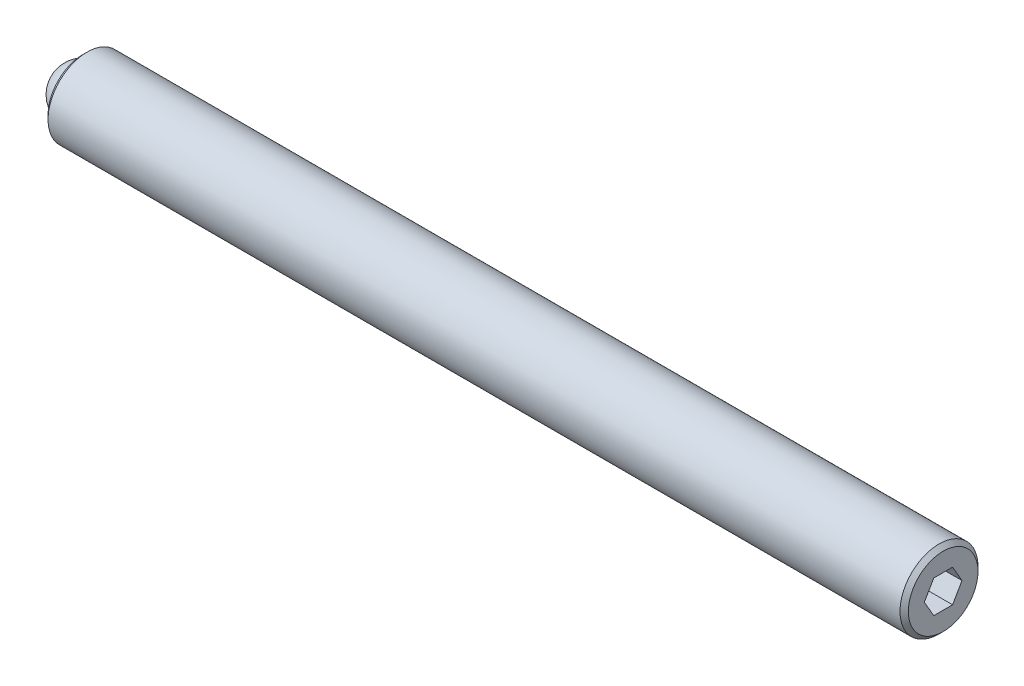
ISO-10303-21;
HEADER;
FILE_DESCRIPTION(('STEP AP214'),'2;1');
FILE_NAME('part.step','',(''),(''),'','','');
FILE_SCHEMA(('AUTOMOTIVE_DESIGN { 1 0 10303 214 1 1 1 1 }'));
ENDSEC;
DATA;
#1=APPLICATION_CONTEXT('core data for automotive mechanical design processes');
#2=APPLICATION_PROTOCOL_DEFINITION('international standard','automotive_design',2000,#1);
#3=PRODUCT_CONTEXT('',#1,'mechanical');
#4=PRODUCT('Part','Part','',(#3));
#5=PRODUCT_RELATED_PRODUCT_CATEGORY('part','',(#4));
#6=PRODUCT_DEFINITION_FORMATION('','',#4);
#7=PRODUCT_DEFINITION_CONTEXT('part definition',#1,'design');
#8=PRODUCT_DEFINITION('design','',#6,#7);
#9=PRODUCT_DEFINITION_SHAPE('','',#8);
#10=(LENGTH_UNIT() NAMED_UNIT(*) SI_UNIT(.MILLI.,.METRE.));
#11=(NAMED_UNIT(*) PLANE_ANGLE_UNIT() SI_UNIT($,.RADIAN.));
#12=(NAMED_UNIT(*) SI_UNIT($,.STERADIAN.) SOLID_ANGLE_UNIT());
#13=UNCERTAINTY_MEASURE_WITH_UNIT(LENGTH_MEASURE(1.E-05),#10,'distance_accuracy_value','');
#14=(GEOMETRIC_REPRESENTATION_CONTEXT(3) GLOBAL_UNCERTAINTY_ASSIGNED_CONTEXT((#13)) GLOBAL_UNIT_ASSIGNED_CONTEXT((#10,
#11,#12)) REPRESENTATION_CONTEXT('',''));
#15=CARTESIAN_POINT('',(0.,0.,0.));
#16=DIRECTION('',(0.,0.,1.));
#17=DIRECTION('',(1.,0.,0.));
#18=AXIS2_PLACEMENT_3D('',#15,#16,#17);
#19=CARTESIAN_POINT('',(0.,0.,0.));
#20=DIRECTION('',(0.,-1.,0.));
#21=DIRECTION('',(0.,0.,1.));
#22=AXIS2_PLACEMENT_3D('',#19,#20,#21);
#23=SPHERICAL_SURFACE('',#22,1.5875);
#24=CARTESIAN_POINT('',(0.,-1.5875,0.));
#25=VERTEX_POINT('',#24);
#26=VERTEX_LOOP('',#25);
#27=FACE_BOUND('',#26,.T.);
#28=ADVANCED_FACE('F41',(#27),#23,.T.);
#29=CLOSED_SHELL('',(#28));
#30=MANIFOLD_SOLID_BREP('B2',#29);
#31=CARTESIAN_POINT('',(52.3875,0.,0.));
#32=DIRECTION('',(-1.,0.,0.));
#33=DIRECTION('',(0.,0.,1.));
#34=AXIS2_PLACEMENT_3D('',#31,#32,#33);
#35=CYLINDRICAL_SURFACE('',#34,2.3749);
#36=CARTESIAN_POINT('',(52.1335,0.,0.));
#37=DIRECTION('',(1.,0.,0.));
#38=DIRECTION('',(0.,0.,-1.));
#39=AXIS2_PLACEMENT_3D('',#36,#37,#38);
#40=CIRCLE('',#39,2.3749);
#41=CARTESIAN_POINT('',(52.1335,0.,-2.3749));
#42=VERTEX_POINT('',#41);
#43=EDGE_CURVE('E39',#42,#42,#40,.F.);
#44=ORIENTED_EDGE('',*,*,#43,.T.);
#45=EDGE_LOOP('',(#44));
#46=FACE_BOUND('',#45,.T.);
#47=CARTESIAN_POINT('',(0.253999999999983,0.,0.));
#48=DIRECTION('',(1.,0.,0.));
#49=DIRECTION('',(0.,0.,-1.));
#50=AXIS2_PLACEMENT_3D('',#47,#48,#49);
#51=CIRCLE('',#50,2.3749);
#52=CARTESIAN_POINT('',(0.253999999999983,0.,-2.3749));
#53=VERTEX_POINT('',#52);
#54=EDGE_CURVE('E157',#53,#53,#51,.T.);
#55=ORIENTED_EDGE('',*,*,#54,.T.);
#56=EDGE_LOOP('',(#55));
#57=FACE_BOUND('',#56,.T.);
#58=ADVANCED_FACE('F54',(#46,#57),#35,.T.);
#59=CARTESIAN_POINT('',(52.3875,0.,0.));
#60=DIRECTION('',(1.,0.,0.));
#61=DIRECTION('',(0.,0.,-1.));
#62=AXIS2_PLACEMENT_3D('',#59,#60,#61);
#63=PLANE('',#62);
#64=DIRECTION('',(0.,0.866025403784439,-0.5));
#65=VECTOR('',#64,1.);
#66=CARTESIAN_POINT('',(52.3875,-0.992187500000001,-0.572839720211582));
#67=LINE('',#66,#65);
#68=CARTESIAN_POINT('',(52.3875,-0.992187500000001,-0.572839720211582));
#69=VERTEX_POINT('',#68);
#70=CARTESIAN_POINT('',(52.3875,0.,-1.14567944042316));
#71=VERTEX_POINT('',#70);
#72=EDGE_CURVE('E69',#69,#71,#67,.T.);
#73=ORIENTED_EDGE('',*,*,#72,.F.);
#74=DIRECTION('',(0.,0.,-1.));
#75=VECTOR('',#74,1.);
#76=CARTESIAN_POINT('',(52.3875,-0.992187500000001,0.572839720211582));
#77=LINE('',#76,#75);
#78=CARTESIAN_POINT('',(52.3875,-0.992187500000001,0.572839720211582));
#79=VERTEX_POINT('',#78);
#80=EDGE_CURVE('E153',#79,#69,#77,.T.);
#81=ORIENTED_EDGE('',*,*,#80,.F.);
#82=DIRECTION('',(0.,-0.866025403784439,-0.5));
#83=VECTOR('',#82,1.);
#84=CARTESIAN_POINT('',(52.3875,0.,1.14567944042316));
#85=LINE('',#84,#83);
#86=CARTESIAN_POINT('',(52.3875,0.,1.14567944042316));
#87=VERTEX_POINT('',#86);
#88=EDGE_CURVE('E151',#87,#79,#85,.T.);
#89=ORIENTED_EDGE('',*,*,#88,.F.);
#90=DIRECTION('',(0.,-0.866025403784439,0.5));
#91=VECTOR('',#90,1.);
#92=CARTESIAN_POINT('',(52.3875,0.992187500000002,0.572839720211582));
#93=LINE('',#92,#91);
#94=CARTESIAN_POINT('',(52.3875,0.992187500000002,0.572839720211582));
#95=VERTEX_POINT('',#94);
#96=EDGE_CURVE('E117',#95,#87,#93,.T.);
#97=ORIENTED_EDGE('',*,*,#96,.F.);
#98=DIRECTION('',(0.,0.,1.));
#99=VECTOR('',#98,1.);
#100=CARTESIAN_POINT('',(52.3875,0.992187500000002,-0.572839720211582));
#101=LINE('',#100,#99);
#102=CARTESIAN_POINT('',(52.3875,0.992187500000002,-0.572839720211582));
#103=VERTEX_POINT('',#102);
#104=EDGE_CURVE('E147',#103,#95,#101,.T.);
#105=ORIENTED_EDGE('',*,*,#104,.F.);
#106=DIRECTION('',(0.,0.866025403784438,0.5));
#107=VECTOR('',#106,1.);
#108=CARTESIAN_POINT('',(52.3875,0.,-1.14567944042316));
#109=LINE('',#108,#107);
#110=EDGE_CURVE('E143',#71,#103,#109,.T.);
#111=ORIENTED_EDGE('',*,*,#110,.F.);
#112=EDGE_LOOP('',(#73,#81,#89,#97,#105,#111));
#113=FACE_BOUND('',#112,.T.);
#114=CARTESIAN_POINT('',(52.3875,0.,0.));
#115=DIRECTION('',(1.,0.,0.));
#116=DIRECTION('',(0.,0.,-1.));
#117=AXIS2_PLACEMENT_3D('',#114,#115,#116);
#118=CIRCLE('',#117,2.12090000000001);
#119=CARTESIAN_POINT('',(52.3875,0.,-2.12090000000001));
#120=VERTEX_POINT('',#119);
#121=EDGE_CURVE('E62',#120,#120,#118,.T.);
#122=ORIENTED_EDGE('',*,*,#121,.T.);
#123=EDGE_LOOP('',(#122));
#124=FACE_BOUND('',#123,.T.);
#125=ADVANCED_FACE('F170',(#113,#124),#63,.T.);
#126=CARTESIAN_POINT('',(0.,0.,0.));
#127=DIRECTION('',(1.,0.,0.));
#128=DIRECTION('',(0.,0.,-1.));
#129=AXIS2_PLACEMENT_3D('',#126,#127,#128);
#130=PLANE('',#129);
#131=CARTESIAN_POINT('',(0.,0.,0.));
#132=DIRECTION('',(-1.,0.,0.));
#133=DIRECTION('',(0.,0.,1.));
#134=AXIS2_PLACEMENT_3D('',#131,#132,#133);
#135=CIRCLE('',#134,1.5875);
#136=CARTESIAN_POINT('',(0.,0.,1.5875));
#137=VERTEX_POINT('',#136);
#138=EDGE_CURVE('E225',#137,#137,#135,.T.);
#139=ORIENTED_EDGE('',*,*,#138,.F.);
#140=EDGE_LOOP('',(#139));
#141=FACE_BOUND('',#140,.T.);
#142=CARTESIAN_POINT('',(0.,0.,0.));
#143=DIRECTION('',(1.,0.,0.));
#144=DIRECTION('',(0.,0.,-1.));
#145=AXIS2_PLACEMENT_3D('',#142,#143,#144);
#146=CIRCLE('',#145,2.12090000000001);
#147=CARTESIAN_POINT('',(0.,0.,-2.12090000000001));
#148=VERTEX_POINT('',#147);
#149=EDGE_CURVE('E165',#148,#148,#146,.F.);
#150=ORIENTED_EDGE('',*,*,#149,.T.);
#151=EDGE_LOOP('',(#150));
#152=FACE_BOUND('',#151,.T.);
#153=ADVANCED_FACE('F182',(#141,#152),#130,.F.);
#154=CARTESIAN_POINT('',(0.253999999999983,0.,0.));
#155=DIRECTION('',(1.,0.,0.));
#156=DIRECTION('',(0.,0.,-1.));
#157=AXIS2_PLACEMENT_3D('',#154,#155,#156);
#158=CONICAL_SURFACE('',#157,2.3749,0.785398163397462);
#159=ORIENTED_EDGE('',*,*,#149,.F.);
#160=EDGE_LOOP('',(#159));
#161=FACE_BOUND('',#160,.T.);
#162=ORIENTED_EDGE('',*,*,#54,.F.);
#163=EDGE_LOOP('',(#162));
#164=FACE_BOUND('',#163,.T.);
#165=ADVANCED_FACE('F174',(#161,#164),#158,.T.);
#166=CARTESIAN_POINT('',(52.3875,0.,0.));
#167=DIRECTION('',(-1.,0.,0.));
#168=DIRECTION('',(0.,0.,1.));
#169=AXIS2_PLACEMENT_3D('',#166,#167,#168);
#170=CONICAL_SURFACE('',#169,2.12090000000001,0.785398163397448);
#171=ORIENTED_EDGE('',*,*,#43,.F.);
#172=EDGE_LOOP('',(#171));
#173=FACE_BOUND('',#172,.T.);
#174=ORIENTED_EDGE('',*,*,#121,.F.);
#175=EDGE_LOOP('',(#174));
#176=FACE_BOUND('',#175,.T.);
#177=ADVANCED_FACE('F56',(#173,#176),#170,.T.);
#178=CARTESIAN_POINT('',(50.1015,-0.992187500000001,-0.572839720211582));
#179=DIRECTION('',(0.,-0.5,-0.866025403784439));
#180=DIRECTION('',(0.,0.866025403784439,-0.5));
#181=AXIS2_PLACEMENT_3D('',#178,#179,#180);
#182=PLANE('',#181);
#183=ORIENTED_EDGE('',*,*,#72,.T.);
#184=DIRECTION('',(1.,0.,0.));
#185=VECTOR('',#184,1.);
#186=CARTESIAN_POINT('',(50.1015,0.,-1.14567944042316));
#187=LINE('',#186,#185);
#188=CARTESIAN_POINT('',(50.1015,0.,-1.14567944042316));
#189=VERTEX_POINT('',#188);
#190=EDGE_CURVE('E99',#189,#71,#187,.T.);
#191=ORIENTED_EDGE('',*,*,#190,.F.);
#192=DIRECTION('',(0.,0.866025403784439,-0.5));
#193=VECTOR('',#192,1.);
#194=CARTESIAN_POINT('',(50.1015,-0.992187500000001,-0.572839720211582));
#195=LINE('',#194,#193);
#196=CARTESIAN_POINT('',(50.1015,-0.992187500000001,-0.572839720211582));
#197=VERTEX_POINT('',#196);
#198=EDGE_CURVE('E155',#197,#189,#195,.T.);
#199=ORIENTED_EDGE('',*,*,#198,.F.);
#200=DIRECTION('',(1.,0.,0.));
#201=VECTOR('',#200,1.);
#202=CARTESIAN_POINT('',(50.1015,-0.992187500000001,-0.572839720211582));
#203=LINE('',#202,#201);
#204=EDGE_CURVE('E77',#197,#69,#203,.T.);
#205=ORIENTED_EDGE('',*,*,#204,.T.);
#206=EDGE_LOOP('',(#183,#191,#199,#205));
#207=FACE_BOUND('',#206,.T.);
#208=ADVANCED_FACE('F173',(#207),#182,.F.);
#209=CARTESIAN_POINT('',(50.1015,-0.992187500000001,0.572839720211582));
#210=DIRECTION('',(0.,-1.,0.));
#211=DIRECTION('',(0.,0.,-1.));
#212=AXIS2_PLACEMENT_3D('',#209,#210,#211);
#213=PLANE('',#212);
#214=ORIENTED_EDGE('',*,*,#80,.T.);
#215=ORIENTED_EDGE('',*,*,#204,.F.);
#216=DIRECTION('',(0.,0.,-1.));
#217=VECTOR('',#216,1.);
#218=CARTESIAN_POINT('',(50.1015,-0.992187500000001,0.572839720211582));
#219=LINE('',#218,#217);
#220=CARTESIAN_POINT('',(50.1015,-0.992187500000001,0.572839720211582));
#221=VERTEX_POINT('',#220);
#222=EDGE_CURVE('E129',#221,#197,#219,.T.);
#223=ORIENTED_EDGE('',*,*,#222,.F.);
#224=DIRECTION('',(1.,0.,0.));
#225=VECTOR('',#224,1.);
#226=CARTESIAN_POINT('',(50.1015,-0.992187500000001,0.572839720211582));
#227=LINE('',#226,#225);
#228=EDGE_CURVE('E121',#221,#79,#227,.T.);
#229=ORIENTED_EDGE('',*,*,#228,.T.);
#230=EDGE_LOOP('',(#214,#215,#223,#229));
#231=FACE_BOUND('',#230,.T.);
#232=ADVANCED_FACE('F180',(#231),#213,.F.);
#233=CARTESIAN_POINT('',(50.1015,0.,1.14567944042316));
#234=DIRECTION('',(0.,-0.5,0.866025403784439));
#235=DIRECTION('',(0.,-0.866025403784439,-0.5));
#236=AXIS2_PLACEMENT_3D('',#233,#234,#235);
#237=PLANE('',#236);
#238=ORIENTED_EDGE('',*,*,#88,.T.);
#239=ORIENTED_EDGE('',*,*,#228,.F.);
#240=DIRECTION('',(0.,-0.866025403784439,-0.5));
#241=VECTOR('',#240,1.);
#242=CARTESIAN_POINT('',(50.1015,0.,1.14567944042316));
#243=LINE('',#242,#241);
#244=CARTESIAN_POINT('',(50.1015,0.,1.14567944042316));
#245=VERTEX_POINT('',#244);
#246=EDGE_CURVE('E125',#245,#221,#243,.T.);
#247=ORIENTED_EDGE('',*,*,#246,.F.);
#248=DIRECTION('',(1.,0.,0.));
#249=VECTOR('',#248,1.);
#250=CARTESIAN_POINT('',(50.1015,0.,1.14567944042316));
#251=LINE('',#250,#249);
#252=EDGE_CURVE('E110',#245,#87,#251,.T.);
#253=ORIENTED_EDGE('',*,*,#252,.T.);
#254=EDGE_LOOP('',(#238,#239,#247,#253));
#255=FACE_BOUND('',#254,.T.);
#256=ADVANCED_FACE('F126',(#255),#237,.F.);
#257=CARTESIAN_POINT('',(50.1015,0.992187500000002,0.572839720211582));
#258=DIRECTION('',(0.,0.5,0.866025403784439));
#259=DIRECTION('',(0.,-0.866025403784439,0.5));
#260=AXIS2_PLACEMENT_3D('',#257,#258,#259);
#261=PLANE('',#260);
#262=ORIENTED_EDGE('',*,*,#96,.T.);
#263=ORIENTED_EDGE('',*,*,#252,.F.);
#264=DIRECTION('',(0.,-0.866025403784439,0.5));
#265=VECTOR('',#264,1.);
#266=CARTESIAN_POINT('',(50.1015,0.992187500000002,0.572839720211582));
#267=LINE('',#266,#265);
#268=CARTESIAN_POINT('',(50.1015,0.992187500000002,0.572839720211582));
#269=VERTEX_POINT('',#268);
#270=EDGE_CURVE('E114',#269,#245,#267,.T.);
#271=ORIENTED_EDGE('',*,*,#270,.F.);
#272=DIRECTION('',(1.,0.,0.));
#273=VECTOR('',#272,1.);
#274=CARTESIAN_POINT('',(50.1015,0.992187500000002,0.572839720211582));
#275=LINE('',#274,#273);
#276=EDGE_CURVE('E122',#269,#95,#275,.T.);
#277=ORIENTED_EDGE('',*,*,#276,.T.);
#278=EDGE_LOOP('',(#262,#263,#271,#277));
#279=FACE_BOUND('',#278,.T.);
#280=ADVANCED_FACE('F112',(#279),#261,.F.);
#281=CARTESIAN_POINT('',(50.1015,0.992187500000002,-0.572839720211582));
#282=DIRECTION('',(0.,1.,0.));
#283=DIRECTION('',(0.,0.,1.));
#284=AXIS2_PLACEMENT_3D('',#281,#282,#283);
#285=PLANE('',#284);
#286=ORIENTED_EDGE('',*,*,#104,.T.);
#287=ORIENTED_EDGE('',*,*,#276,.F.);
#288=DIRECTION('',(0.,0.,1.));
#289=VECTOR('',#288,1.);
#290=CARTESIAN_POINT('',(50.1015,0.992187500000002,-0.572839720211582));
#291=LINE('',#290,#289);
#292=CARTESIAN_POINT('',(50.1015,0.992187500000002,-0.572839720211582));
#293=VERTEX_POINT('',#292);
#294=EDGE_CURVE('E135',#293,#269,#291,.T.);
#295=ORIENTED_EDGE('',*,*,#294,.F.);
#296=DIRECTION('',(1.,0.,0.));
#297=VECTOR('',#296,1.);
#298=CARTESIAN_POINT('',(50.1015,0.992187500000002,-0.572839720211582));
#299=LINE('',#298,#297);
#300=EDGE_CURVE('E160',#293,#103,#299,.T.);
#301=ORIENTED_EDGE('',*,*,#300,.T.);
#302=EDGE_LOOP('',(#286,#287,#295,#301));
#303=FACE_BOUND('',#302,.T.);
#304=ADVANCED_FACE('F201',(#303),#285,.F.);
#305=CARTESIAN_POINT('',(50.1015,0.,-1.14567944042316));
#306=DIRECTION('',(0.,0.5,-0.866025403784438));
#307=DIRECTION('',(0.,0.866025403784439,0.5));
#308=AXIS2_PLACEMENT_3D('',#305,#306,#307);
#309=PLANE('',#308);
#310=ORIENTED_EDGE('',*,*,#110,.T.);
#311=ORIENTED_EDGE('',*,*,#300,.F.);
#312=DIRECTION('',(0.,0.866025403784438,0.5));
#313=VECTOR('',#312,1.);
#314=CARTESIAN_POINT('',(50.1015,0.,-1.14567944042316));
#315=LINE('',#314,#313);
#316=EDGE_CURVE('E137',#189,#293,#315,.T.);
#317=ORIENTED_EDGE('',*,*,#316,.F.);
#318=ORIENTED_EDGE('',*,*,#190,.T.);
#319=EDGE_LOOP('',(#310,#311,#317,#318));
#320=FACE_BOUND('',#319,.T.);
#321=ADVANCED_FACE('F198',(#320),#309,.F.);
#322=CARTESIAN_POINT('',(50.1015,0.,0.));
#323=DIRECTION('',(1.,0.,0.));
#324=DIRECTION('',(0.,0.,-1.));
#325=AXIS2_PLACEMENT_3D('',#322,#323,#324);
#326=PLANE('',#325);
#327=ORIENTED_EDGE('',*,*,#198,.T.);
#328=ORIENTED_EDGE('',*,*,#316,.T.);
#329=ORIENTED_EDGE('',*,*,#294,.T.);
#330=ORIENTED_EDGE('',*,*,#270,.T.);
#331=ORIENTED_EDGE('',*,*,#246,.T.);
#332=ORIENTED_EDGE('',*,*,#222,.T.);
#333=EDGE_LOOP('',(#327,#328,#329,#330,#331,#332));
#334=FACE_BOUND('',#333,.T.);
#335=ADVANCED_FACE('F132',(#334),#326,.T.);
#336=CARTESIAN_POINT('',(1.5875,0.,0.));
#337=DIRECTION('',(-1.,0.,0.));
#338=DIRECTION('',(0.,0.,1.));
#339=AXIS2_PLACEMENT_3D('',#336,#337,#338);
#340=CYLINDRICAL_SURFACE('',#339,1.5875);
#341=CARTESIAN_POINT('',(1.5875,0.,0.));
#342=DIRECTION('',(-1.,0.,0.));
#343=DIRECTION('',(0.,0.,1.));
#344=AXIS2_PLACEMENT_3D('',#341,#342,#343);
#345=CIRCLE('',#344,1.5875);
#346=CARTESIAN_POINT('',(1.5875,0.,1.5875));
#347=VERTEX_POINT('',#346);
#348=EDGE_CURVE('E144',#347,#347,#345,.T.);
#349=ORIENTED_EDGE('',*,*,#348,.F.);
#350=EDGE_LOOP('',(#349));
#351=FACE_BOUND('',#350,.T.);
#352=ORIENTED_EDGE('',*,*,#138,.T.);
#353=EDGE_LOOP('',(#352));
#354=FACE_BOUND('',#353,.T.);
#355=ADVANCED_FACE('F214',(#351,#354),#340,.F.);
#356=CARTESIAN_POINT('',(1.5875,0.,0.));
#357=DIRECTION('',(-1.,0.,0.));
#358=DIRECTION('',(0.,0.,1.));
#359=AXIS2_PLACEMENT_3D('',#356,#357,#358);
#360=PLANE('',#359);
#361=ORIENTED_EDGE('',*,*,#348,.T.);
#362=EDGE_LOOP('',(#361));
#363=FACE_BOUND('',#362,.T.);
#364=ADVANCED_FACE('F217',(#363),#360,.T.);
#365=CLOSED_SHELL('',(#58,#125,#153,#165,#177,#208,#232,#256,#280,#304,#321,#335,#355,#364));
#366=MANIFOLD_SOLID_BREP('B6',#365);
#367=ADVANCED_BREP_SHAPE_REPRESENTATION('',(#18,#30,#366),#14);
#368=SHAPE_DEFINITION_REPRESENTATION(#9,#367);
ENDSEC;
END-ISO-10303-21;
